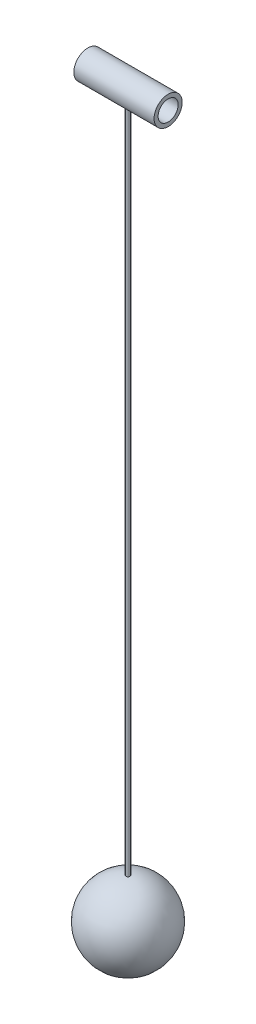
from build123d import *

# Parameters (mm, degrees)
SCHIZZO1_W        = 20
SCHIZZO1_H        = 1
ESTRUSIONE1_START = -170.012508
SCHIZZO3_R        = 0.5
ESTRUSIONE1_DEPTH = 166.548406


with BuildPart() as part:
    # Schizzo1 → Rivoluzione-Sottile1 (revolve)
    with BuildSketch(Plane.XY, mode=Mode.PRIVATE) as rivoluzione_sottile1_sk:
        with Locations((0, -3)):
            Rectangle(SCHIZZO1_W, SCHIZZO1_H)
    revolve(rivoluzione_sottile1_sk.sketch.rotate(Axis((-68.299524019, 0, 0), (1, 0, 0)), 270), axis=Axis((-68.299524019, 0, 0), (1, 0, 0)))



with BuildPart() as body_2:
    # Schizzo2 → Rivoluzione1 (revolve)
    with BuildSketch(Plane.XY):
        with BuildLine():
            Line((0, -170), (0, -190))
            ThreePointArc((0, -190), (-10, -180), (0, -170))
        make_face()
    revolve(axis=Axis((0, 0, 0), (0, -1, 0)))


with BuildPart() as part_1:
    add(part.part)

    add(body_2.part)  # Estrusione1 merges body 2
    # Schizzo3 → Estrusione1 (add)
    with BuildSketch(Plane(origin=(0, 0, 0), x_dir=(1, 0, 0), z_dir=(0, 1, 0)).offset(ESTRUSIONE1_START)):
        with Locations(Location((0, 0, 0), (0, 0, 270))):
            Circle(SCHIZZO3_R)
    extrude(amount=ESTRUSIONE1_DEPTH)


solid = part_1.part
